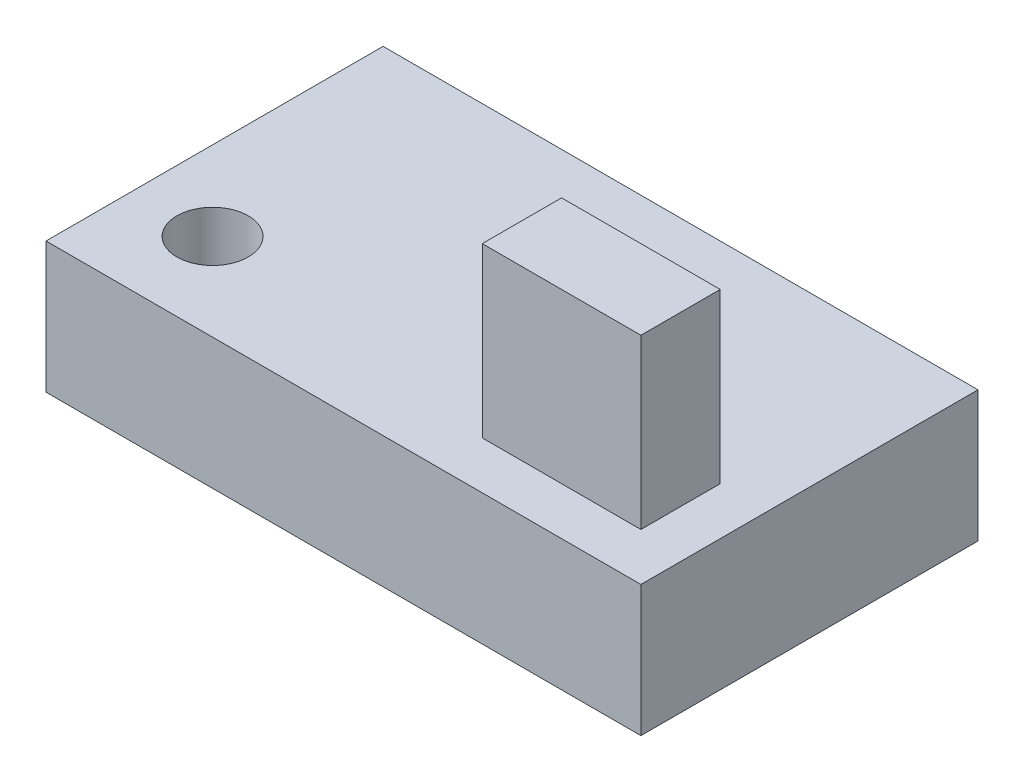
ISO-10303-21;
HEADER;
FILE_DESCRIPTION(('STEP AP214'),'2;1');
FILE_NAME('part.step','',(''),(''),'','','');
FILE_SCHEMA(('AUTOMOTIVE_DESIGN { 1 0 10303 214 1 1 1 1 }'));
ENDSEC;
DATA;
#1=APPLICATION_CONTEXT('core data for automotive mechanical design processes');
#2=APPLICATION_PROTOCOL_DEFINITION('international standard','automotive_design',2000,#1);
#3=PRODUCT_CONTEXT('',#1,'mechanical');
#4=PRODUCT('Part','Part','',(#3));
#5=PRODUCT_RELATED_PRODUCT_CATEGORY('part','',(#4));
#6=PRODUCT_DEFINITION_FORMATION('','',#4);
#7=PRODUCT_DEFINITION_CONTEXT('part definition',#1,'design');
#8=PRODUCT_DEFINITION('design','',#6,#7);
#9=PRODUCT_DEFINITION_SHAPE('','',#8);
#10=(LENGTH_UNIT() NAMED_UNIT(*) SI_UNIT(.MILLI.,.METRE.));
#11=(NAMED_UNIT(*) PLANE_ANGLE_UNIT() SI_UNIT($,.RADIAN.));
#12=(NAMED_UNIT(*) SI_UNIT($,.STERADIAN.) SOLID_ANGLE_UNIT());
#13=UNCERTAINTY_MEASURE_WITH_UNIT(LENGTH_MEASURE(1.E-05),#10,'distance_accuracy_value','');
#14=(GEOMETRIC_REPRESENTATION_CONTEXT(3) GLOBAL_UNCERTAINTY_ASSIGNED_CONTEXT((#13)) GLOBAL_UNIT_ASSIGNED_CONTEXT((#10,
#11,#12)) REPRESENTATION_CONTEXT('',''));
#15=CARTESIAN_POINT('',(0.,0.,0.));
#16=DIRECTION('',(0.,0.,1.));
#17=DIRECTION('',(1.,0.,0.));
#18=AXIS2_PLACEMENT_3D('',#15,#16,#17);
#19=CARTESIAN_POINT('',(0.,16.51,0.));
#20=DIRECTION('',(0.,-1.,0.));
#21=DIRECTION('',(0.,0.,-1.));
#22=AXIS2_PLACEMENT_3D('',#19,#20,#21);
#23=PLANE('',#22);
#24=CARTESIAN_POINT('',(-55.,16.51,20.5));
#25=DIRECTION('',(0.,1.,0.));
#26=DIRECTION('',(0.,0.,1.));
#27=AXIS2_PLACEMENT_3D('',#24,#25,#26);
#28=CIRCLE('',#27,9.);
#29=CARTESIAN_POINT('',(-55.,16.51,29.5));
#30=VERTEX_POINT('',#29);
#31=EDGE_CURVE('E218',#30,#30,#28,.T.);
#32=ORIENTED_EDGE('',*,*,#31,.F.);
#33=EDGE_LOOP('',(#32));
#34=FACE_BOUND('',#33,.T.);
#35=DIRECTION('',(0.,0.,-1.));
#36=VECTOR('',#35,1.);
#37=CARTESIAN_POINT('',(-75.,16.51,42.5));
#38=LINE('',#37,#36);
#39=CARTESIAN_POINT('',(-75.,16.51,42.5));
#40=VERTEX_POINT('',#39);
#41=CARTESIAN_POINT('',(-75.,16.51,-42.5));
#42=VERTEX_POINT('',#41);
#43=EDGE_CURVE('E120',#40,#42,#38,.T.);
#44=ORIENTED_EDGE('',*,*,#43,.F.);
#45=DIRECTION('',(-1.,0.,0.));
#46=VECTOR('',#45,1.);
#47=CARTESIAN_POINT('',(-75.,16.51,42.5));
#48=LINE('',#47,#46);
#49=CARTESIAN_POINT('',(75.,16.51,42.5));
#50=VERTEX_POINT('',#49);
#51=EDGE_CURVE('E133',#50,#40,#48,.T.);
#52=ORIENTED_EDGE('',*,*,#51,.F.);
#53=DIRECTION('',(0.,0.,1.));
#54=VECTOR('',#53,1.);
#55=CARTESIAN_POINT('',(75.,16.51,42.5));
#56=LINE('',#55,#54);
#57=CARTESIAN_POINT('',(75.,16.51,-42.5));
#58=VERTEX_POINT('',#57);
#59=EDGE_CURVE('E141',#58,#50,#56,.T.);
#60=ORIENTED_EDGE('',*,*,#59,.F.);
#61=DIRECTION('',(1.,0.,0.));
#62=VECTOR('',#61,1.);
#63=CARTESIAN_POINT('',(-75.,16.51,-42.5));
#64=LINE('',#63,#62);
#65=EDGE_CURVE('E123',#42,#58,#64,.T.);
#66=ORIENTED_EDGE('',*,*,#65,.F.);
#67=EDGE_LOOP('',(#44,#52,#60,#66));
#68=FACE_BOUND('',#67,.T.);
#69=DIRECTION('',(0.,0.,-1.));
#70=VECTOR('',#69,1.);
#71=CARTESIAN_POINT('',(63.,16.51,30.5));
#72=LINE('',#71,#70);
#73=CARTESIAN_POINT('',(63.,16.51,30.5));
#74=VERTEX_POINT('',#73);
#75=CARTESIAN_POINT('',(63.,16.51,10.5));
#76=VERTEX_POINT('',#75);
#77=EDGE_CURVE('E119',#74,#76,#72,.T.);
#78=ORIENTED_EDGE('',*,*,#77,.F.);
#79=DIRECTION('',(1.,0.,0.));
#80=VECTOR('',#79,1.);
#81=CARTESIAN_POINT('',(63.,16.51,30.5));
#82=LINE('',#81,#80);
#83=CARTESIAN_POINT('',(23.,16.51,30.5));
#84=VERTEX_POINT('',#83);
#85=EDGE_CURVE('E116',#84,#74,#82,.T.);
#86=ORIENTED_EDGE('',*,*,#85,.F.);
#87=DIRECTION('',(0.,0.,1.));
#88=VECTOR('',#87,1.);
#89=CARTESIAN_POINT('',(23.,16.51,30.5));
#90=LINE('',#89,#88);
#91=CARTESIAN_POINT('',(23.,16.51,10.5));
#92=VERTEX_POINT('',#91);
#93=EDGE_CURVE('E54',#92,#84,#90,.T.);
#94=ORIENTED_EDGE('',*,*,#93,.F.);
#95=DIRECTION('',(-1.,0.,0.));
#96=VECTOR('',#95,1.);
#97=CARTESIAN_POINT('',(63.,16.51,10.5));
#98=LINE('',#97,#96);
#99=EDGE_CURVE('E49',#76,#92,#98,.T.);
#100=ORIENTED_EDGE('',*,*,#99,.F.);
#101=EDGE_LOOP('',(#78,#86,#94,#100));
#102=FACE_BOUND('',#101,.T.);
#103=ADVANCED_FACE('F34',(#34,#68,#102),#23,.F.);
#104=CARTESIAN_POINT('',(-75.,-16.51,42.5));
#105=DIRECTION('',(1.,0.,0.));
#106=DIRECTION('',(0.,0.,-1.));
#107=AXIS2_PLACEMENT_3D('',#104,#105,#106);
#108=PLANE('',#107);
#109=ORIENTED_EDGE('',*,*,#43,.T.);
#110=DIRECTION('',(0.,1.,0.));
#111=VECTOR('',#110,1.);
#112=CARTESIAN_POINT('',(-75.,-16.51,-42.5));
#113=LINE('',#112,#111);
#114=CARTESIAN_POINT('',(-75.,-16.51,-42.5));
#115=VERTEX_POINT('',#114);
#116=EDGE_CURVE('E11',#115,#42,#113,.T.);
#117=ORIENTED_EDGE('',*,*,#116,.F.);
#118=DIRECTION('',(0.,0.,-1.));
#119=VECTOR('',#118,1.);
#120=CARTESIAN_POINT('',(-75.,-16.51,42.5));
#121=LINE('',#120,#119);
#122=CARTESIAN_POINT('',(-75.,-16.51,42.5));
#123=VERTEX_POINT('',#122);
#124=EDGE_CURVE('E129',#123,#115,#121,.T.);
#125=ORIENTED_EDGE('',*,*,#124,.F.);
#126=DIRECTION('',(0.,1.,0.));
#127=VECTOR('',#126,1.);
#128=CARTESIAN_POINT('',(-75.,-16.51,42.5));
#129=LINE('',#128,#127);
#130=EDGE_CURVE('E138',#123,#40,#129,.T.);
#131=ORIENTED_EDGE('',*,*,#130,.T.);
#132=EDGE_LOOP('',(#109,#117,#125,#131));
#133=FACE_BOUND('',#132,.T.);
#134=ADVANCED_FACE('F36',(#133),#108,.F.);
#135=CARTESIAN_POINT('',(-75.,-16.51,-42.5));
#136=DIRECTION('',(0.,0.,1.));
#137=DIRECTION('',(1.,0.,0.));
#138=AXIS2_PLACEMENT_3D('',#135,#136,#137);
#139=PLANE('',#138);
#140=ORIENTED_EDGE('',*,*,#65,.T.);
#141=DIRECTION('',(0.,1.,0.));
#142=VECTOR('',#141,1.);
#143=CARTESIAN_POINT('',(75.,-16.51,-42.5));
#144=LINE('',#143,#142);
#145=CARTESIAN_POINT('',(75.,-16.51,-42.5));
#146=VERTEX_POINT('',#145);
#147=EDGE_CURVE('E42',#146,#58,#144,.T.);
#148=ORIENTED_EDGE('',*,*,#147,.F.);
#149=DIRECTION('',(1.,0.,0.));
#150=VECTOR('',#149,1.);
#151=CARTESIAN_POINT('',(-75.,-16.51,-42.5));
#152=LINE('',#151,#150);
#153=EDGE_CURVE('E132',#115,#146,#152,.T.);
#154=ORIENTED_EDGE('',*,*,#153,.F.);
#155=ORIENTED_EDGE('',*,*,#116,.T.);
#156=EDGE_LOOP('',(#140,#148,#154,#155));
#157=FACE_BOUND('',#156,.T.);
#158=ADVANCED_FACE('F168',(#157),#139,.F.);
#159=CARTESIAN_POINT('',(75.,-16.51,42.5));
#160=DIRECTION('',(-1.,0.,0.));
#161=DIRECTION('',(0.,0.,1.));
#162=AXIS2_PLACEMENT_3D('',#159,#160,#161);
#163=PLANE('',#162);
#164=ORIENTED_EDGE('',*,*,#59,.T.);
#165=DIRECTION('',(0.,1.,0.));
#166=VECTOR('',#165,1.);
#167=CARTESIAN_POINT('',(75.,-16.51,42.5));
#168=LINE('',#167,#166);
#169=CARTESIAN_POINT('',(75.,-16.51,42.5));
#170=VERTEX_POINT('',#169);
#171=EDGE_CURVE('E146',#170,#50,#168,.T.);
#172=ORIENTED_EDGE('',*,*,#171,.F.);
#173=DIRECTION('',(0.,0.,1.));
#174=VECTOR('',#173,1.);
#175=CARTESIAN_POINT('',(75.,-16.51,42.5));
#176=LINE('',#175,#174);
#177=EDGE_CURVE('E135',#146,#170,#176,.T.);
#178=ORIENTED_EDGE('',*,*,#177,.F.);
#179=ORIENTED_EDGE('',*,*,#147,.T.);
#180=EDGE_LOOP('',(#164,#172,#178,#179));
#181=FACE_BOUND('',#180,.T.);
#182=ADVANCED_FACE('F153',(#181),#163,.F.);
#183=CARTESIAN_POINT('',(-75.,-16.51,42.5));
#184=DIRECTION('',(0.,0.,-1.));
#185=DIRECTION('',(-1.,0.,0.));
#186=AXIS2_PLACEMENT_3D('',#183,#184,#185);
#187=PLANE('',#186);
#188=ORIENTED_EDGE('',*,*,#51,.T.);
#189=ORIENTED_EDGE('',*,*,#130,.F.);
#190=DIRECTION('',(-1.,0.,0.));
#191=VECTOR('',#190,1.);
#192=CARTESIAN_POINT('',(-75.,-16.51,42.5));
#193=LINE('',#192,#191);
#194=EDGE_CURVE('E137',#170,#123,#193,.T.);
#195=ORIENTED_EDGE('',*,*,#194,.F.);
#196=ORIENTED_EDGE('',*,*,#171,.T.);
#197=EDGE_LOOP('',(#188,#189,#195,#196));
#198=FACE_BOUND('',#197,.T.);
#199=ADVANCED_FACE('F161',(#198),#187,.F.);
#200=CARTESIAN_POINT('',(0.,-16.51,0.));
#201=DIRECTION('',(0.,-1.,0.));
#202=DIRECTION('',(0.,0.,-1.));
#203=AXIS2_PLACEMENT_3D('',#200,#201,#202);
#204=PLANE('',#203);
#205=ORIENTED_EDGE('',*,*,#124,.T.);
#206=ORIENTED_EDGE('',*,*,#153,.T.);
#207=ORIENTED_EDGE('',*,*,#177,.T.);
#208=ORIENTED_EDGE('',*,*,#194,.T.);
#209=EDGE_LOOP('',(#205,#206,#207,#208));
#210=FACE_BOUND('',#209,.T.);
#211=ADVANCED_FACE('F167',(#210),#204,.T.);
#212=CARTESIAN_POINT('',(63.,58.928,30.5));
#213=DIRECTION('',(-1.,0.,0.));
#214=DIRECTION('',(0.,0.,1.));
#215=AXIS2_PLACEMENT_3D('',#212,#213,#214);
#216=PLANE('',#215);
#217=ORIENTED_EDGE('',*,*,#77,.T.);
#218=DIRECTION('',(0.,-1.,0.));
#219=VECTOR('',#218,1.);
#220=CARTESIAN_POINT('',(63.,58.928,10.5));
#221=LINE('',#220,#219);
#222=CARTESIAN_POINT('',(63.,58.928,10.5));
#223=VERTEX_POINT('',#222);
#224=EDGE_CURVE('E100',#223,#76,#221,.T.);
#225=ORIENTED_EDGE('',*,*,#224,.F.);
#226=DIRECTION('',(0.,0.,-1.));
#227=VECTOR('',#226,1.);
#228=CARTESIAN_POINT('',(63.,58.928,30.5));
#229=LINE('',#228,#227);
#230=CARTESIAN_POINT('',(63.,58.928,30.5));
#231=VERTEX_POINT('',#230);
#232=EDGE_CURVE('E107',#231,#223,#229,.T.);
#233=ORIENTED_EDGE('',*,*,#232,.F.);
#234=DIRECTION('',(0.,-1.,0.));
#235=VECTOR('',#234,1.);
#236=CARTESIAN_POINT('',(63.,58.928,30.5));
#237=LINE('',#236,#235);
#238=EDGE_CURVE('E225',#231,#74,#237,.T.);
#239=ORIENTED_EDGE('',*,*,#238,.T.);
#240=EDGE_LOOP('',(#217,#225,#233,#239));
#241=FACE_BOUND('',#240,.T.);
#242=ADVANCED_FACE('F118',(#241),#216,.F.);
#243=CARTESIAN_POINT('',(63.,58.928,10.5));
#244=DIRECTION('',(0.,0.,1.));
#245=DIRECTION('',(1.,0.,0.));
#246=AXIS2_PLACEMENT_3D('',#243,#244,#245);
#247=PLANE('',#246);
#248=ORIENTED_EDGE('',*,*,#99,.T.);
#249=DIRECTION('',(0.,-1.,0.));
#250=VECTOR('',#249,1.);
#251=CARTESIAN_POINT('',(23.,58.928,10.5));
#252=LINE('',#251,#250);
#253=CARTESIAN_POINT('',(23.,58.928,10.5));
#254=VERTEX_POINT('',#253);
#255=EDGE_CURVE('E103',#254,#92,#252,.T.);
#256=ORIENTED_EDGE('',*,*,#255,.F.);
#257=DIRECTION('',(-1.,0.,0.));
#258=VECTOR('',#257,1.);
#259=CARTESIAN_POINT('',(63.,58.928,10.5));
#260=LINE('',#259,#258);
#261=EDGE_CURVE('E96',#223,#254,#260,.T.);
#262=ORIENTED_EDGE('',*,*,#261,.F.);
#263=ORIENTED_EDGE('',*,*,#224,.T.);
#264=EDGE_LOOP('',(#248,#256,#262,#263));
#265=FACE_BOUND('',#264,.T.);
#266=ADVANCED_FACE('F98',(#265),#247,.F.);
#267=CARTESIAN_POINT('',(23.,58.928,30.5));
#268=DIRECTION('',(1.,0.,0.));
#269=DIRECTION('',(0.,0.,-1.));
#270=AXIS2_PLACEMENT_3D('',#267,#268,#269);
#271=PLANE('',#270);
#272=ORIENTED_EDGE('',*,*,#93,.T.);
#273=DIRECTION('',(0.,-1.,0.));
#274=VECTOR('',#273,1.);
#275=CARTESIAN_POINT('',(23.,58.928,30.5));
#276=LINE('',#275,#274);
#277=CARTESIAN_POINT('',(23.,58.928,30.5));
#278=VERTEX_POINT('',#277);
#279=EDGE_CURVE('E125',#278,#84,#276,.T.);
#280=ORIENTED_EDGE('',*,*,#279,.F.);
#281=DIRECTION('',(0.,0.,1.));
#282=VECTOR('',#281,1.);
#283=CARTESIAN_POINT('',(23.,58.928,30.5));
#284=LINE('',#283,#282);
#285=EDGE_CURVE('E106',#254,#278,#284,.T.);
#286=ORIENTED_EDGE('',*,*,#285,.F.);
#287=ORIENTED_EDGE('',*,*,#255,.T.);
#288=EDGE_LOOP('',(#272,#280,#286,#287));
#289=FACE_BOUND('',#288,.T.);
#290=ADVANCED_FACE('F194',(#289),#271,.F.);
#291=CARTESIAN_POINT('',(63.,58.928,30.5));
#292=DIRECTION('',(0.,0.,-1.));
#293=DIRECTION('',(-1.,0.,0.));
#294=AXIS2_PLACEMENT_3D('',#291,#292,#293);
#295=PLANE('',#294);
#296=ORIENTED_EDGE('',*,*,#85,.T.);
#297=ORIENTED_EDGE('',*,*,#238,.F.);
#298=DIRECTION('',(1.,0.,0.));
#299=VECTOR('',#298,1.);
#300=CARTESIAN_POINT('',(63.,58.928,30.5));
#301=LINE('',#300,#299);
#302=EDGE_CURVE('E112',#278,#231,#301,.T.);
#303=ORIENTED_EDGE('',*,*,#302,.F.);
#304=ORIENTED_EDGE('',*,*,#279,.T.);
#305=EDGE_LOOP('',(#296,#297,#303,#304));
#306=FACE_BOUND('',#305,.T.);
#307=ADVANCED_FACE('F199',(#306),#295,.F.);
#308=CARTESIAN_POINT('',(0.,58.928,0.));
#309=DIRECTION('',(0.,1.,0.));
#310=DIRECTION('',(0.,0.,1.));
#311=AXIS2_PLACEMENT_3D('',#308,#309,#310);
#312=PLANE('',#311);
#313=ORIENTED_EDGE('',*,*,#232,.T.);
#314=ORIENTED_EDGE('',*,*,#261,.T.);
#315=ORIENTED_EDGE('',*,*,#285,.T.);
#316=ORIENTED_EDGE('',*,*,#302,.T.);
#317=EDGE_LOOP('',(#313,#314,#315,#316));
#318=FACE_BOUND('',#317,.T.);
#319=ADVANCED_FACE('F110',(#318),#312,.T.);
#320=CARTESIAN_POINT('',(-55.,1.51,20.5));
#321=DIRECTION('',(0.,1.,0.));
#322=DIRECTION('',(0.,0.,1.));
#323=AXIS2_PLACEMENT_3D('',#320,#321,#322);
#324=CYLINDRICAL_SURFACE('',#323,9.);
#325=CARTESIAN_POINT('',(-55.,1.51,20.5));
#326=DIRECTION('',(0.,1.,0.));
#327=DIRECTION('',(0.,0.,1.));
#328=AXIS2_PLACEMENT_3D('',#325,#326,#327);
#329=CIRCLE('',#328,9.);
#330=CARTESIAN_POINT('',(-55.,1.51,29.5));
#331=VERTEX_POINT('',#330);
#332=EDGE_CURVE('E217',#331,#331,#329,.T.);
#333=ORIENTED_EDGE('',*,*,#332,.F.);
#334=EDGE_LOOP('',(#333));
#335=FACE_BOUND('',#334,.T.);
#336=ORIENTED_EDGE('',*,*,#31,.T.);
#337=EDGE_LOOP('',(#336));
#338=FACE_BOUND('',#337,.T.);
#339=ADVANCED_FACE('F206',(#335,#338),#324,.F.);
#340=CARTESIAN_POINT('',(-55.,1.51,20.5));
#341=DIRECTION('',(0.,1.,0.));
#342=DIRECTION('',(0.,0.,1.));
#343=AXIS2_PLACEMENT_3D('',#340,#341,#342);
#344=PLANE('',#343);
#345=ORIENTED_EDGE('',*,*,#332,.T.);
#346=EDGE_LOOP('',(#345));
#347=FACE_BOUND('',#346,.T.);
#348=ADVANCED_FACE('F209',(#347),#344,.T.);
#349=CLOSED_SHELL('',(#103,#134,#158,#182,#199,#211,#242,#266,#290,#307,#319,#339,#348));
#350=MANIFOLD_SOLID_BREP('B2',#349);
#351=ADVANCED_BREP_SHAPE_REPRESENTATION('',(#18,#350),#14);
#352=SHAPE_DEFINITION_REPRESENTATION(#9,#351);
ENDSEC;
END-ISO-10303-21;
